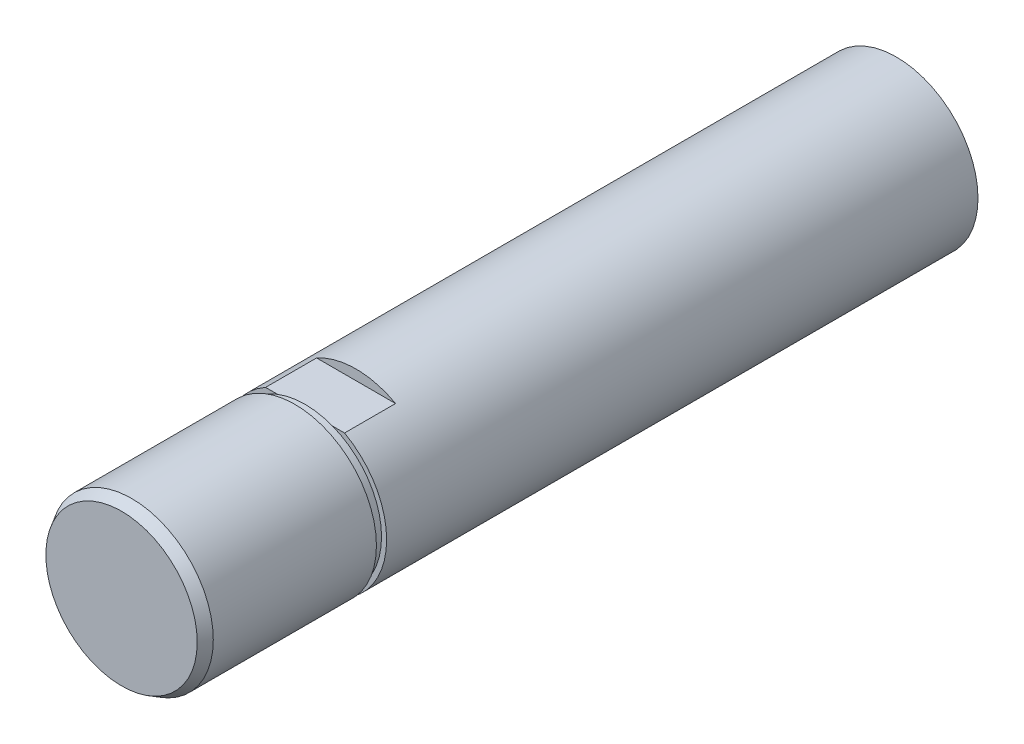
from build123d import *

# Parameters (mm, degrees)
SKETCH1_R        = 8
STROKE_DEPTH     = 50
EXTRUDE_START    = 8
SKETCH2_R        = 8
EXTRUDE_L2_DEPTH = 8
EXTRUDE_START_2  = 18
SKETCH3_R        = 8
EXTRUDE_L3_DEPTH = 18
CHAMFER2_SIZE    = 1
CHAMFER2_SIZE2   = 0.577350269
U_C_START        = 1
SKETCH5_R        = 8
SKETCH5_R_2      = 7.5
U_C_DEPTH        = 1
SKETCH6_W        = 5
SKETCH6_H        = 3.381540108
SKETCH6_H_2      = 4.212063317
A_F_DEPTH        = 10.5


with BuildPart() as part:
    # Sketch1 → STROKE (new body)
    with BuildSketch(Plane.XY):
        Circle(SKETCH1_R)
    extrude(amount=-STROKE_DEPTH)

    # Sketch2 → Extrude L2 (add)
    with BuildSketch(Plane.XY.offset(EXTRUDE_START)):
        Circle(SKETCH2_R)
    extrude(amount=-EXTRUDE_L2_DEPTH)

    # Sketch3 → Extrude L3 (add)
    with BuildSketch(Plane.XY.offset(8).offset(EXTRUDE_START_2)):
        Circle(SKETCH3_R)
    extrude(amount=-EXTRUDE_L3_DEPTH)

    # Chamfer2
    chamfer2_edges = [part.edges().sort_by_distance(p)[0] for p in [
        (-8, 0, 26),
    ]]
    chamfer2_side = [part.faces().sort_by_distance(p)[0] for p in [
        (-8, 0, -12),
    ]]
    chamfer(chamfer2_edges, length=CHAMFER2_SIZE, length2=CHAMFER2_SIZE2, reference=chamfer2_side[0])

    # Sketch5 → U_C (cut)
    with BuildSketch(Plane.XY.offset(8).offset(U_C_START)):
        Circle(SKETCH5_R)
        Circle(SKETCH5_R_2, mode=Mode.SUBTRACT)
    extrude(amount=-U_C_DEPTH, mode=Mode.SUBTRACT)

    # Sketch6 → A_F (cut, symmetric)
    with BuildSketch(Plane(origin=(0, 0, 0), x_dir=(0, 0, -1), z_dir=(1, 0, 0))):
        with Locations((-5.5, 8.690770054)):
            Rectangle(SKETCH6_W, SKETCH6_H)
        with Locations((-5.5, -9.106031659)):
            Rectangle(SKETCH6_W, SKETCH6_H_2)
    extrude(amount=A_F_DEPTH, both=True, mode=Mode.SUBTRACT)


solid = part.part
